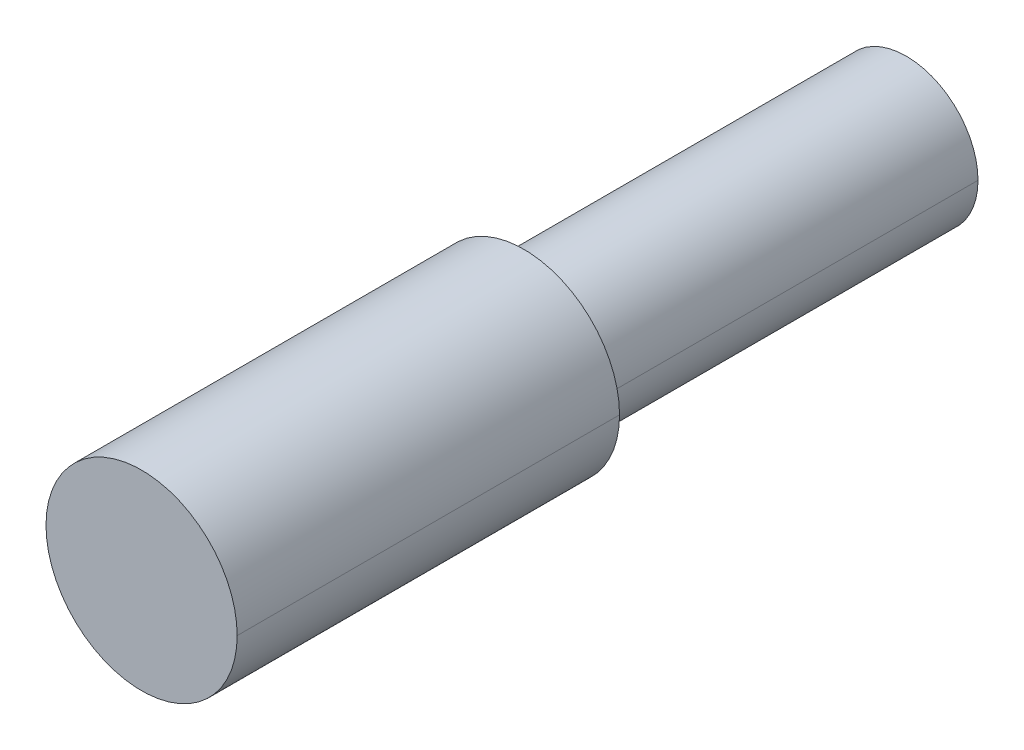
ISO-10303-21;
HEADER;
FILE_DESCRIPTION(('STEP AP214'),'2;1');
FILE_NAME('part.step','',(''),(''),'','','');
FILE_SCHEMA(('AUTOMOTIVE_DESIGN { 1 0 10303 214 1 1 1 1 }'));
ENDSEC;
DATA;
#1=APPLICATION_CONTEXT('core data for automotive mechanical design processes');
#2=APPLICATION_PROTOCOL_DEFINITION('international standard','automotive_design',2000,#1);
#3=PRODUCT_CONTEXT('',#1,'mechanical');
#4=PRODUCT('Part','Part','',(#3));
#5=PRODUCT_RELATED_PRODUCT_CATEGORY('part','',(#4));
#6=PRODUCT_DEFINITION_FORMATION('','',#4);
#7=PRODUCT_DEFINITION_CONTEXT('part definition',#1,'design');
#8=PRODUCT_DEFINITION('design','',#6,#7);
#9=PRODUCT_DEFINITION_SHAPE('','',#8);
#10=(LENGTH_UNIT() NAMED_UNIT(*) SI_UNIT(.MILLI.,.METRE.));
#11=(NAMED_UNIT(*) PLANE_ANGLE_UNIT() SI_UNIT($,.RADIAN.));
#12=(NAMED_UNIT(*) SI_UNIT($,.STERADIAN.) SOLID_ANGLE_UNIT());
#13=UNCERTAINTY_MEASURE_WITH_UNIT(LENGTH_MEASURE(1.E-05),#10,'distance_accuracy_value','');
#14=(GEOMETRIC_REPRESENTATION_CONTEXT(3) GLOBAL_UNCERTAINTY_ASSIGNED_CONTEXT((#13)) GLOBAL_UNIT_ASSIGNED_CONTEXT((#10,
#11,#12)) REPRESENTATION_CONTEXT('',''));
#15=CARTESIAN_POINT('',(0.,0.,0.));
#16=DIRECTION('',(0.,0.,1.));
#17=DIRECTION('',(1.,0.,0.));
#18=AXIS2_PLACEMENT_3D('',#15,#16,#17);
#19=CARTESIAN_POINT('',(0.,0.,-25.4));
#20=DIRECTION('',(0.,0.,-1.));
#21=DIRECTION('',(-1.,0.,0.));
#22=AXIS2_PLACEMENT_3D('',#19,#20,#21);
#23=PLANE('',#22);
#24=CARTESIAN_POINT('',(0.,0.,-25.4));
#25=DIRECTION('',(0.,0.,1.));
#26=DIRECTION('',(1.,0.,0.));
#27=AXIS2_PLACEMENT_3D('',#24,#25,#26);
#28=CIRCLE('',#27,4.7625);
#29=CARTESIAN_POINT('',(-4.7625,0.,-25.4));
#30=VERTEX_POINT('',#29);
#31=CARTESIAN_POINT('',(4.7625,0.,-25.4));
#32=VERTEX_POINT('',#31);
#33=EDGE_CURVE('E63',#30,#32,#28,.T.);
#34=ORIENTED_EDGE('',*,*,#33,.F.);
#35=CARTESIAN_POINT('',(0.,0.,-25.4));
#36=DIRECTION('',(0.,0.,1.));
#37=DIRECTION('',(1.,0.,0.));
#38=AXIS2_PLACEMENT_3D('',#35,#36,#37);
#39=CIRCLE('',#38,4.7625);
#40=EDGE_CURVE('E19',#32,#30,#39,.T.);
#41=ORIENTED_EDGE('',*,*,#40,.F.);
#42=EDGE_LOOP('',(#34,#41));
#43=FACE_BOUND('',#42,.T.);
#44=ADVANCED_FACE('F16',(#43),#23,.T.);
#45=CARTESIAN_POINT('',(0.,0.,-12.7));
#46=DIRECTION('',(0.,0.,1.));
#47=DIRECTION('',(1.,0.,0.));
#48=AXIS2_PLACEMENT_3D('',#45,#46,#47);
#49=CYLINDRICAL_SURFACE('',#48,4.7625);
#50=DIRECTION('',(0.,0.,1.));
#51=VECTOR('',#50,1.);
#52=CARTESIAN_POINT('',(-4.7625,0.,-12.7));
#53=LINE('',#52,#51);
#54=CARTESIAN_POINT('',(-4.7625,0.,0.));
#55=VERTEX_POINT('',#54);
#56=EDGE_CURVE('E58',#55,#30,#53,.F.);
#57=ORIENTED_EDGE('',*,*,#56,.F.);
#58=CARTESIAN_POINT('',(0.,0.,0.));
#59=DIRECTION('',(0.,0.,1.));
#60=DIRECTION('',(1.,0.,0.));
#61=AXIS2_PLACEMENT_3D('',#58,#59,#60);
#62=CIRCLE('',#61,4.7625);
#63=CARTESIAN_POINT('',(4.7625,0.,0.));
#64=VERTEX_POINT('',#63);
#65=EDGE_CURVE('E65',#64,#55,#62,.T.);
#66=ORIENTED_EDGE('',*,*,#65,.F.);
#67=DIRECTION('',(0.,0.,1.));
#68=VECTOR('',#67,1.);
#69=CARTESIAN_POINT('',(4.7625,0.,-12.7));
#70=LINE('',#69,#68);
#71=EDGE_CURVE('E61',#32,#64,#70,.T.);
#72=ORIENTED_EDGE('',*,*,#71,.F.);
#73=ORIENTED_EDGE('',*,*,#40,.T.);
#74=EDGE_LOOP('',(#57,#66,#72,#73));
#75=FACE_BOUND('',#74,.T.);
#76=ADVANCED_FACE('F56',(#75),#49,.T.);
#77=CARTESIAN_POINT('',(0.,0.,-12.7));
#78=DIRECTION('',(0.,0.,1.));
#79=DIRECTION('',(1.,0.,0.));
#80=AXIS2_PLACEMENT_3D('',#77,#78,#79);
#81=CYLINDRICAL_SURFACE('',#80,4.7625);
#82=ORIENTED_EDGE('',*,*,#56,.T.);
#83=ORIENTED_EDGE('',*,*,#33,.T.);
#84=ORIENTED_EDGE('',*,*,#71,.T.);
#85=CARTESIAN_POINT('',(0.,0.,0.));
#86=DIRECTION('',(0.,0.,1.));
#87=DIRECTION('',(1.,0.,0.));
#88=AXIS2_PLACEMENT_3D('',#85,#86,#87);
#89=CIRCLE('',#88,4.7625);
#90=EDGE_CURVE('E68',#55,#64,#89,.T.);
#91=ORIENTED_EDGE('',*,*,#90,.F.);
#92=EDGE_LOOP('',(#82,#83,#84,#91));
#93=FACE_BOUND('',#92,.T.);
#94=ADVANCED_FACE('F66',(#93),#81,.T.);
#95=CARTESIAN_POINT('',(0.,0.,0.));
#96=DIRECTION('',(0.,0.,-1.));
#97=DIRECTION('',(-1.,0.,0.));
#98=AXIS2_PLACEMENT_3D('',#95,#96,#97);
#99=PLANE('',#98);
#100=ORIENTED_EDGE('',*,*,#65,.T.);
#101=ORIENTED_EDGE('',*,*,#90,.T.);
#102=EDGE_LOOP('',(#100,#101));
#103=FACE_BOUND('',#102,.T.);
#104=CARTESIAN_POINT('',(0.,0.,0.));
#105=DIRECTION('',(0.,0.,1.));
#106=DIRECTION('',(1.,0.,0.));
#107=AXIS2_PLACEMENT_3D('',#104,#105,#106);
#108=CIRCLE('',#107,6.35);
#109=CARTESIAN_POINT('',(-6.35,0.,0.));
#110=VERTEX_POINT('',#109);
#111=CARTESIAN_POINT('',(6.35,0.,0.));
#112=VERTEX_POINT('',#111);
#113=EDGE_CURVE('E79',#110,#112,#108,.T.);
#114=ORIENTED_EDGE('',*,*,#113,.F.);
#115=CARTESIAN_POINT('',(0.,0.,0.));
#116=DIRECTION('',(0.,0.,1.));
#117=DIRECTION('',(1.,0.,0.));
#118=AXIS2_PLACEMENT_3D('',#115,#116,#117);
#119=CIRCLE('',#118,6.35);
#120=EDGE_CURVE('E74',#112,#110,#119,.T.);
#121=ORIENTED_EDGE('',*,*,#120,.F.);
#122=EDGE_LOOP('',(#114,#121));
#123=FACE_BOUND('',#122,.T.);
#124=ADVANCED_FACE('F83',(#103,#123),#99,.T.);
#125=CARTESIAN_POINT('',(0.,0.,12.7));
#126=DIRECTION('',(0.,0.,1.));
#127=DIRECTION('',(1.,0.,0.));
#128=AXIS2_PLACEMENT_3D('',#125,#126,#127);
#129=CYLINDRICAL_SURFACE('',#128,6.35);
#130=DIRECTION('',(0.,0.,1.));
#131=VECTOR('',#130,1.);
#132=CARTESIAN_POINT('',(-6.35,0.,12.7));
#133=LINE('',#132,#131);
#134=CARTESIAN_POINT('',(-6.35,0.,25.4));
#135=VERTEX_POINT('',#134);
#136=EDGE_CURVE('E25',#110,#135,#133,.T.);
#137=ORIENTED_EDGE('',*,*,#136,.F.);
#138=ORIENTED_EDGE('',*,*,#113,.T.);
#139=DIRECTION('',(0.,0.,1.));
#140=VECTOR('',#139,1.);
#141=CARTESIAN_POINT('',(6.35,0.,12.7));
#142=LINE('',#141,#140);
#143=CARTESIAN_POINT('',(6.35,0.,25.4));
#144=VERTEX_POINT('',#143);
#145=EDGE_CURVE('E77',#144,#112,#142,.F.);
#146=ORIENTED_EDGE('',*,*,#145,.F.);
#147=CARTESIAN_POINT('',(0.,0.,25.4));
#148=DIRECTION('',(0.,0.,1.));
#149=DIRECTION('',(1.,0.,0.));
#150=AXIS2_PLACEMENT_3D('',#147,#148,#149);
#151=CIRCLE('',#150,6.35);
#152=EDGE_CURVE('E34',#135,#144,#151,.T.);
#153=ORIENTED_EDGE('',*,*,#152,.F.);
#154=EDGE_LOOP('',(#137,#138,#146,#153));
#155=FACE_BOUND('',#154,.T.);
#156=ADVANCED_FACE('F86',(#155),#129,.T.);
#157=CARTESIAN_POINT('',(0.,0.,25.4));
#158=DIRECTION('',(0.,0.,1.));
#159=DIRECTION('',(1.,0.,0.));
#160=AXIS2_PLACEMENT_3D('',#157,#158,#159);
#161=PLANE('',#160);
#162=CARTESIAN_POINT('',(0.,0.,25.4));
#163=DIRECTION('',(0.,0.,1.));
#164=DIRECTION('',(1.,0.,0.));
#165=AXIS2_PLACEMENT_3D('',#162,#163,#164);
#166=CIRCLE('',#165,6.35);
#167=EDGE_CURVE('E11',#135,#144,#166,.F.);
#168=ORIENTED_EDGE('',*,*,#167,.F.);
#169=ORIENTED_EDGE('',*,*,#152,.T.);
#170=EDGE_LOOP('',(#168,#169));
#171=FACE_BOUND('',#170,.T.);
#172=ADVANCED_FACE('F95',(#171),#161,.T.);
#173=CARTESIAN_POINT('',(0.,0.,12.7));
#174=DIRECTION('',(0.,0.,1.));
#175=DIRECTION('',(1.,0.,0.));
#176=AXIS2_PLACEMENT_3D('',#173,#174,#175);
#177=CYLINDRICAL_SURFACE('',#176,6.35);
#178=ORIENTED_EDGE('',*,*,#136,.T.);
#179=ORIENTED_EDGE('',*,*,#167,.T.);
#180=ORIENTED_EDGE('',*,*,#145,.T.);
#181=ORIENTED_EDGE('',*,*,#120,.T.);
#182=EDGE_LOOP('',(#178,#179,#180,#181));
#183=FACE_BOUND('',#182,.T.);
#184=ADVANCED_FACE('F93',(#183),#177,.T.);
#185=CLOSED_SHELL('',(#44,#76,#94,#124,#156,#172,#184));
#186=MANIFOLD_SOLID_BREP('B1',#185);
#187=ADVANCED_BREP_SHAPE_REPRESENTATION('',(#18,#186),#14);
#188=SHAPE_DEFINITION_REPRESENTATION(#9,#187);
ENDSEC;
END-ISO-10303-21;
